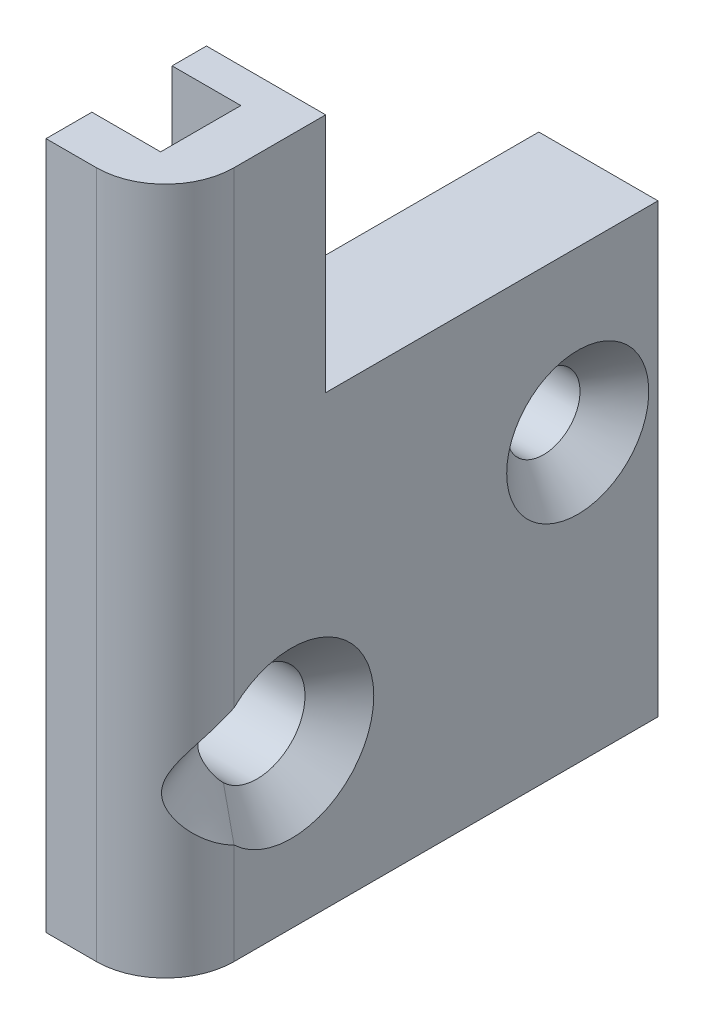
ISO-10303-21;
HEADER;
FILE_DESCRIPTION(('STEP AP214'),'2;1');
FILE_NAME('part.step','',(''),(''),'','','');
FILE_SCHEMA(('AUTOMOTIVE_DESIGN { 1 0 10303 214 1 1 1 1 }'));
ENDSEC;
DATA;
#1=APPLICATION_CONTEXT('core data for automotive mechanical design processes');
#2=APPLICATION_PROTOCOL_DEFINITION('international standard','automotive_design',2000,#1);
#3=PRODUCT_CONTEXT('',#1,'mechanical');
#4=PRODUCT('Part','Part','',(#3));
#5=PRODUCT_RELATED_PRODUCT_CATEGORY('part','',(#4));
#6=PRODUCT_DEFINITION_FORMATION('','',#4);
#7=PRODUCT_DEFINITION_CONTEXT('part definition',#1,'design');
#8=PRODUCT_DEFINITION('design','',#6,#7);
#9=PRODUCT_DEFINITION_SHAPE('','',#8);
#10=(LENGTH_UNIT() NAMED_UNIT(*) SI_UNIT(.MILLI.,.METRE.));
#11=(NAMED_UNIT(*) PLANE_ANGLE_UNIT() SI_UNIT($,.RADIAN.));
#12=(NAMED_UNIT(*) SI_UNIT($,.STERADIAN.) SOLID_ANGLE_UNIT());
#13=UNCERTAINTY_MEASURE_WITH_UNIT(LENGTH_MEASURE(1.E-05),#10,'distance_accuracy_value','');
#14=(GEOMETRIC_REPRESENTATION_CONTEXT(3) GLOBAL_UNCERTAINTY_ASSIGNED_CONTEXT((#13)) GLOBAL_UNIT_ASSIGNED_CONTEXT((#10,
#11,#12)) REPRESENTATION_CONTEXT('',''));
#15=CARTESIAN_POINT('',(0.,0.,0.));
#16=DIRECTION('',(0.,0.,1.));
#17=DIRECTION('',(1.,0.,0.));
#18=AXIS2_PLACEMENT_3D('',#15,#16,#17);
#19=CARTESIAN_POINT('',(5.2,19.5,0.));
#20=DIRECTION('',(0.,0.,1.));
#21=DIRECTION('',(1.,0.,0.));
#22=AXIS2_PLACEMENT_3D('',#19,#20,#21);
#23=PLANE('',#22);
#24=DIRECTION('',(0.,1.,0.));
#25=VECTOR('',#24,1.);
#26=CARTESIAN_POINT('',(0.,19.5,0.));
#27=LINE('',#26,#25);
#28=CARTESIAN_POINT('',(0.,0.,0.));
#29=VERTEX_POINT('',#28);
#30=CARTESIAN_POINT('',(0.,19.5,0.));
#31=VERTEX_POINT('',#30);
#32=EDGE_CURVE('E236',#29,#31,#27,.T.);
#33=ORIENTED_EDGE('',*,*,#32,.T.);
#34=DIRECTION('',(-1.,0.,0.));
#35=VECTOR('',#34,1.);
#36=CARTESIAN_POINT('',(5.2,19.5,0.));
#37=LINE('',#36,#35);
#38=CARTESIAN_POINT('',(5.2,19.5,0.));
#39=VERTEX_POINT('',#38);
#40=EDGE_CURVE('E280',#39,#31,#37,.T.);
#41=ORIENTED_EDGE('',*,*,#40,.F.);
#42=DIRECTION('',(0.,1.,0.));
#43=VECTOR('',#42,1.);
#44=CARTESIAN_POINT('',(5.2,19.5,0.));
#45=LINE('',#44,#43);
#46=CARTESIAN_POINT('',(5.2,0.,0.));
#47=VERTEX_POINT('',#46);
#48=EDGE_CURVE('E240',#47,#39,#45,.T.);
#49=ORIENTED_EDGE('',*,*,#48,.F.);
#50=DIRECTION('',(-1.,0.,0.));
#51=VECTOR('',#50,1.);
#52=CARTESIAN_POINT('',(5.2,0.,0.));
#53=LINE('',#52,#51);
#54=EDGE_CURVE('E253',#47,#29,#53,.T.);
#55=ORIENTED_EDGE('',*,*,#54,.T.);
#56=EDGE_LOOP('',(#33,#41,#49,#55));
#57=FACE_BOUND('',#56,.T.);
#58=ADVANCED_FACE('F35',(#57),#23,.F.);
#59=CARTESIAN_POINT('',(5.2,19.5,14.5));
#60=DIRECTION('',(0.,-1.,0.));
#61=DIRECTION('',(0.,0.,-1.));
#62=AXIS2_PLACEMENT_3D('',#59,#60,#61);
#63=PLANE('',#62);
#64=DIRECTION('',(0.,0.,1.));
#65=VECTOR('',#64,1.);
#66=CARTESIAN_POINT('',(0.,19.5,14.5));
#67=LINE('',#66,#65);
#68=CARTESIAN_POINT('',(0.,19.5,14.5));
#69=VERTEX_POINT('',#68);
#70=EDGE_CURVE('E256',#31,#69,#67,.T.);
#71=ORIENTED_EDGE('',*,*,#70,.T.);
#72=DIRECTION('',(-1.,0.,0.));
#73=VECTOR('',#72,1.);
#74=CARTESIAN_POINT('',(5.2,19.5,14.5));
#75=LINE('',#74,#73);
#76=CARTESIAN_POINT('',(5.2,19.5,14.5));
#77=VERTEX_POINT('',#76);
#78=EDGE_CURVE('E277',#77,#69,#75,.T.);
#79=ORIENTED_EDGE('',*,*,#78,.F.);
#80=DIRECTION('',(0.,0.,1.));
#81=VECTOR('',#80,1.);
#82=CARTESIAN_POINT('',(5.2,19.5,14.5));
#83=LINE('',#82,#81);
#84=EDGE_CURVE('E243',#39,#77,#83,.T.);
#85=ORIENTED_EDGE('',*,*,#84,.F.);
#86=ORIENTED_EDGE('',*,*,#40,.T.);
#87=EDGE_LOOP('',(#71,#79,#85,#86));
#88=FACE_BOUND('',#87,.T.);
#89=ADVANCED_FACE('F484',(#88),#63,.F.);
#90=CARTESIAN_POINT('',(5.2,30.,14.5));
#91=DIRECTION('',(0.,0.,1.));
#92=DIRECTION('',(0.,-1.,0.));
#93=AXIS2_PLACEMENT_3D('',#90,#91,#92);
#94=PLANE('',#93);
#95=DIRECTION('',(0.,1.,0.));
#96=VECTOR('',#95,1.);
#97=CARTESIAN_POINT('',(0.,30.,14.5));
#98=LINE('',#97,#96);
#99=CARTESIAN_POINT('',(0.,30.,14.5));
#100=VERTEX_POINT('',#99);
#101=EDGE_CURVE('E258',#69,#100,#98,.T.);
#102=ORIENTED_EDGE('',*,*,#101,.T.);
#103=DIRECTION('',(-1.,0.,0.));
#104=VECTOR('',#103,1.);
#105=CARTESIAN_POINT('',(5.2,30.,14.5));
#106=LINE('',#105,#104);
#107=CARTESIAN_POINT('',(5.2,30.,14.5));
#108=VERTEX_POINT('',#107);
#109=EDGE_CURVE('E274',#108,#100,#106,.T.);
#110=ORIENTED_EDGE('',*,*,#109,.F.);
#111=DIRECTION('',(0.,1.,0.));
#112=VECTOR('',#111,1.);
#113=CARTESIAN_POINT('',(5.2,30.,14.5));
#114=LINE('',#113,#112);
#115=EDGE_CURVE('E246',#77,#108,#114,.T.);
#116=ORIENTED_EDGE('',*,*,#115,.F.);
#117=ORIENTED_EDGE('',*,*,#78,.T.);
#118=EDGE_LOOP('',(#102,#110,#116,#117));
#119=FACE_BOUND('',#118,.T.);
#120=ADVANCED_FACE('F365',(#119),#94,.F.);
#121=CARTESIAN_POINT('',(5.2,30.,21.5));
#122=DIRECTION('',(0.,-1.,0.));
#123=DIRECTION('',(0.,0.,-1.));
#124=AXIS2_PLACEMENT_3D('',#121,#122,#123);
#125=PLANE('',#124);
#126=DIRECTION('',(-1.,0.,0.));
#127=VECTOR('',#126,1.);
#128=CARTESIAN_POINT('',(5.2,30.,21.5));
#129=LINE('',#128,#127);
#130=CARTESIAN_POINT('',(2.2,30.,21.5));
#131=VERTEX_POINT('',#130);
#132=CARTESIAN_POINT('',(0.,30.,21.5));
#133=VERTEX_POINT('',#132);
#134=EDGE_CURVE('E272',#131,#133,#129,.T.);
#135=ORIENTED_EDGE('',*,*,#134,.F.);
#136=CARTESIAN_POINT('',(2.2,30.,18.5));
#137=DIRECTION('',(0.,-1.,0.));
#138=DIRECTION('',(0.,0.,-1.));
#139=AXIS2_PLACEMENT_3D('',#136,#137,#138);
#140=CIRCLE('',#139,3.);
#141=CARTESIAN_POINT('',(5.2,30.,18.5));
#142=VERTEX_POINT('',#141);
#143=EDGE_CURVE('E336',#131,#142,#140,.F.);
#144=ORIENTED_EDGE('',*,*,#143,.T.);
#145=DIRECTION('',(0.,0.,1.));
#146=VECTOR('',#145,1.);
#147=CARTESIAN_POINT('',(5.2,30.,21.5));
#148=LINE('',#147,#146);
#149=EDGE_CURVE('E248',#108,#142,#148,.T.);
#150=ORIENTED_EDGE('',*,*,#149,.F.);
#151=ORIENTED_EDGE('',*,*,#109,.T.);
#152=DIRECTION('',(0.,0.,1.));
#153=VECTOR('',#152,1.);
#154=CARTESIAN_POINT('',(0.,30.,21.5));
#155=LINE('',#154,#153);
#156=CARTESIAN_POINT('',(0.,30.,16.));
#157=VERTEX_POINT('',#156);
#158=EDGE_CURVE('E261',#100,#157,#155,.T.);
#159=ORIENTED_EDGE('',*,*,#158,.T.);
#160=DIRECTION('',(-1.,0.,0.));
#161=VECTOR('',#160,1.);
#162=CARTESIAN_POINT('',(3.,30.,16.));
#163=LINE('',#162,#161);
#164=CARTESIAN_POINT('',(3.,30.,16.));
#165=VERTEX_POINT('',#164);
#166=EDGE_CURVE('E226',#165,#157,#163,.T.);
#167=ORIENTED_EDGE('',*,*,#166,.F.);
#168=DIRECTION('',(0.,0.,-1.));
#169=VECTOR('',#168,1.);
#170=CARTESIAN_POINT('',(3.,30.,19.5));
#171=LINE('',#170,#169);
#172=CARTESIAN_POINT('',(3.,30.,19.5));
#173=VERTEX_POINT('',#172);
#174=EDGE_CURVE('E215',#173,#165,#171,.T.);
#175=ORIENTED_EDGE('',*,*,#174,.F.);
#176=DIRECTION('',(-1.,0.,0.));
#177=VECTOR('',#176,1.);
#178=CARTESIAN_POINT('',(3.,30.,19.5));
#179=LINE('',#178,#177);
#180=CARTESIAN_POINT('',(0.,30.,19.5));
#181=VERTEX_POINT('',#180);
#182=EDGE_CURVE('E189',#173,#181,#179,.T.);
#183=ORIENTED_EDGE('',*,*,#182,.T.);
#184=EDGE_CURVE('E260',#181,#133,#155,.T.);
#185=ORIENTED_EDGE('',*,*,#184,.T.);
#186=EDGE_LOOP('',(#135,#144,#150,#151,#159,#167,#175,#183,#185));
#187=FACE_BOUND('',#186,.T.);
#188=ADVANCED_FACE('F357',(#187),#125,.F.);
#189=CARTESIAN_POINT('',(5.2,0.,21.5));
#190=DIRECTION('',(0.,0.,-1.));
#191=DIRECTION('',(-1.,0.,0.));
#192=AXIS2_PLACEMENT_3D('',#189,#190,#191);
#193=PLANE('',#192);
#194=DIRECTION('',(-1.,0.,0.));
#195=VECTOR('',#194,1.);
#196=CARTESIAN_POINT('',(5.2,0.,21.5));
#197=LINE('',#196,#195);
#198=CARTESIAN_POINT('',(2.2,0.,21.5));
#199=VERTEX_POINT('',#198);
#200=CARTESIAN_POINT('',(0.,0.,21.5));
#201=VERTEX_POINT('',#200);
#202=EDGE_CURVE('E270',#199,#201,#197,.T.);
#203=ORIENTED_EDGE('',*,*,#202,.F.);
#204=DIRECTION('',(0.,-1.,0.));
#205=VECTOR('',#204,1.);
#206=CARTESIAN_POINT('',(2.2,0.,21.5));
#207=LINE('',#206,#205);
#208=EDGE_CURVE('E337',#199,#131,#207,.F.);
#209=ORIENTED_EDGE('',*,*,#208,.T.);
#210=ORIENTED_EDGE('',*,*,#134,.T.);
#211=DIRECTION('',(0.,-1.,0.));
#212=VECTOR('',#211,1.);
#213=CARTESIAN_POINT('',(0.,0.,21.5));
#214=LINE('',#213,#212);
#215=EDGE_CURVE('E264',#133,#201,#214,.T.);
#216=ORIENTED_EDGE('',*,*,#215,.T.);
#217=EDGE_LOOP('',(#203,#209,#210,#216));
#218=FACE_BOUND('',#217,.T.);
#219=ADVANCED_FACE('F349',(#218),#193,.F.);
#220=CARTESIAN_POINT('',(5.2,0.,0.));
#221=DIRECTION('',(0.,1.,0.));
#222=DIRECTION('',(0.,0.,1.));
#223=AXIS2_PLACEMENT_3D('',#220,#221,#222);
#224=PLANE('',#223);
#225=DIRECTION('',(0.,0.,-1.));
#226=VECTOR('',#225,1.);
#227=CARTESIAN_POINT('',(5.2,0.,0.));
#228=LINE('',#227,#226);
#229=CARTESIAN_POINT('',(5.2,0.,18.5));
#230=VERTEX_POINT('',#229);
#231=EDGE_CURVE('E251',#230,#47,#228,.T.);
#232=ORIENTED_EDGE('',*,*,#231,.F.);
#233=CARTESIAN_POINT('',(2.2,0.,18.5));
#234=DIRECTION('',(0.,1.,0.));
#235=DIRECTION('',(0.,0.,1.));
#236=AXIS2_PLACEMENT_3D('',#233,#234,#235);
#237=CIRCLE('',#236,3.);
#238=EDGE_CURVE('E323',#230,#199,#237,.F.);
#239=ORIENTED_EDGE('',*,*,#238,.T.);
#240=ORIENTED_EDGE('',*,*,#202,.T.);
#241=DIRECTION('',(0.,0.,-1.));
#242=VECTOR('',#241,1.);
#243=CARTESIAN_POINT('',(0.,0.,0.));
#244=LINE('',#243,#242);
#245=EDGE_CURVE('E244',#201,#29,#244,.T.);
#246=ORIENTED_EDGE('',*,*,#245,.T.);
#247=ORIENTED_EDGE('',*,*,#54,.F.);
#248=EDGE_LOOP('',(#232,#239,#240,#246,#247));
#249=FACE_BOUND('',#248,.T.);
#250=ADVANCED_FACE('F345',(#249),#224,.F.);
#251=CARTESIAN_POINT('',(5.2,0.,0.));
#252=DIRECTION('',(-1.,0.,0.));
#253=DIRECTION('',(0.,0.,1.));
#254=AXIS2_PLACEMENT_3D('',#251,#252,#253);
#255=PLANE('',#254);
#256=CARTESIAN_POINT('',(5.2,12.5,3.5));
#257=DIRECTION('',(-1.,0.,0.));
#258=DIRECTION('',(0.,0.,1.));
#259=AXIS2_PLACEMENT_3D('',#256,#257,#258);
#260=CIRCLE('',#259,3.1);
#261=CARTESIAN_POINT('',(5.2,12.5,6.6));
#262=VERTEX_POINT('',#261);
#263=EDGE_CURVE('E512',#262,#262,#260,.T.);
#264=ORIENTED_EDGE('',*,*,#263,.T.);
#265=EDGE_LOOP('',(#264));
#266=FACE_BOUND('',#265,.T.);
#267=DIRECTION('',(0.,-1.,0.));
#268=VECTOR('',#267,1.);
#269=CARTESIAN_POINT('',(5.2,0.,18.5));
#270=LINE('',#269,#268);
#271=CARTESIAN_POINT('',(5.2,9.59036676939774,18.5));
#272=VERTEX_POINT('',#271);
#273=EDGE_CURVE('E329',#142,#272,#270,.T.);
#274=ORIENTED_EDGE('',*,*,#273,.T.);
#275=CARTESIAN_POINT('',(5.2,7.,16.));
#276=DIRECTION('',(-1.,0.,0.));
#277=DIRECTION('',(0.,0.,1.));
#278=AXIS2_PLACEMENT_3D('',#275,#276,#277);
#279=CIRCLE('',#278,3.60000000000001);
#280=CARTESIAN_POINT('',(5.2,4.40963323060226,18.5));
#281=VERTEX_POINT('',#280);
#282=EDGE_CURVE('E335',#272,#281,#279,.T.);
#283=ORIENTED_EDGE('',*,*,#282,.T.);
#284=EDGE_CURVE('E320',#281,#230,#270,.T.);
#285=ORIENTED_EDGE('',*,*,#284,.T.);
#286=ORIENTED_EDGE('',*,*,#231,.T.);
#287=ORIENTED_EDGE('',*,*,#48,.T.);
#288=ORIENTED_EDGE('',*,*,#84,.T.);
#289=ORIENTED_EDGE('',*,*,#115,.T.);
#290=ORIENTED_EDGE('',*,*,#149,.T.);
#291=EDGE_LOOP('',(#274,#283,#285,#286,#287,#288,#289,#290));
#292=FACE_BOUND('',#291,.T.);
#293=ADVANCED_FACE('F360',(#266,#292),#255,.F.);
#294=CARTESIAN_POINT('',(0.,0.,0.));
#295=DIRECTION('',(-1.,0.,0.));
#296=DIRECTION('',(0.,0.,1.));
#297=AXIS2_PLACEMENT_3D('',#294,#295,#296);
#298=PLANE('',#297);
#299=CARTESIAN_POINT('',(0.,7.,16.));
#300=DIRECTION('',(-1.,0.,0.));
#301=DIRECTION('',(0.,0.,1.));
#302=AXIS2_PLACEMENT_3D('',#299,#300,#301);
#303=CIRCLE('',#302,2.1);
#304=CARTESIAN_POINT('',(0.,7.,18.1));
#305=VERTEX_POINT('',#304);
#306=EDGE_CURVE('E206',#305,#305,#303,.F.);
#307=ORIENTED_EDGE('',*,*,#306,.T.);
#308=EDGE_LOOP('',(#307));
#309=FACE_BOUND('',#308,.T.);
#310=CARTESIAN_POINT('',(0.,12.5,3.5));
#311=DIRECTION('',(-1.,0.,0.));
#312=DIRECTION('',(0.,0.,1.));
#313=AXIS2_PLACEMENT_3D('',#310,#311,#312);
#314=CIRCLE('',#313,1.6);
#315=CARTESIAN_POINT('',(0.,12.5,5.1));
#316=VERTEX_POINT('',#315);
#317=EDGE_CURVE('E209',#316,#316,#314,.F.);
#318=ORIENTED_EDGE('',*,*,#317,.T.);
#319=EDGE_LOOP('',(#318));
#320=FACE_BOUND('',#319,.T.);
#321=CARTESIAN_POINT('',(0.,17.,16.5));
#322=DIRECTION('',(-1.,0.,0.));
#323=DIRECTION('',(0.,0.,1.));
#324=AXIS2_PLACEMENT_3D('',#321,#322,#323);
#325=CIRCLE('',#324,3.);
#326=CARTESIAN_POINT('',(0.,17.,19.5));
#327=VERTEX_POINT('',#326);
#328=CARTESIAN_POINT('',(0.,14.5335393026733,18.2077973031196));
#329=VERTEX_POINT('',#328);
#330=EDGE_CURVE('E295',#327,#329,#325,.F.);
#331=ORIENTED_EDGE('',*,*,#330,.T.);
#332=CARTESIAN_POINT('',(0.,-1.90953201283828,29.5931126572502));
#333=DIRECTION('',(-1.,0.,0.));
#334=DIRECTION('',(0.,0.,1.));
#335=AXIS2_PLACEMENT_3D('',#332,#333,#334);
#336=CIRCLE('',#335,20.);
#337=CARTESIAN_POINT('',(0.,8.80206786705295,12.7034226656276));
#338=VERTEX_POINT('',#337);
#339=EDGE_CURVE('E303',#329,#338,#336,.T.);
#340=ORIENTED_EDGE('',*,*,#339,.T.);
#341=DIRECTION('',(0.,0.844484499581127,0.535579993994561));
#342=VECTOR('',#341,1.);
#343=CARTESIAN_POINT('',(0.,2.48989002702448,8.70018024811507));
#344=LINE('',#343,#342);
#345=CARTESIAN_POINT('',(0.,2.48989002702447,8.70018024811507));
#346=VERTEX_POINT('',#345);
#347=EDGE_CURVE('E232',#346,#338,#344,.T.);
#348=ORIENTED_EDGE('',*,*,#347,.F.);
#349=CARTESIAN_POINT('',(0.,4.9,4.9));
#350=DIRECTION('',(-1.,0.,0.));
#351=DIRECTION('',(0.,0.,1.));
#352=AXIS2_PLACEMENT_3D('',#349,#350,#351);
#353=CIRCLE('',#352,4.5);
#354=CARTESIAN_POINT('',(0.,8.48124602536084,2.17517396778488));
#355=VERTEX_POINT('',#354);
#356=EDGE_CURVE('E185',#355,#346,#353,.T.);
#357=ORIENTED_EDGE('',*,*,#356,.F.);
#358=DIRECTION('',(0.,-0.605516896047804,-0.795832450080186));
#359=VECTOR('',#358,1.);
#360=CARTESIAN_POINT('',(0.,8.48124602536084,2.17517396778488));
#361=LINE('',#360,#359);
#362=CARTESIAN_POINT('',(0.,18.0995610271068,14.8165506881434));
#363=VERTEX_POINT('',#362);
#364=EDGE_CURVE('E229',#363,#355,#361,.T.);
#365=ORIENTED_EDGE('',*,*,#364,.F.);
#366=CARTESIAN_POINT('',(0.,20.4870583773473,13.));
#367=DIRECTION('',(-1.,0.,0.));
#368=DIRECTION('',(0.,0.,1.));
#369=AXIS2_PLACEMENT_3D('',#366,#367,#368);
#370=CIRCLE('',#369,3.);
#371=CARTESIAN_POINT('',(0.,20.4870583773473,16.));
#372=VERTEX_POINT('',#371);
#373=EDGE_CURVE('E291',#363,#372,#370,.T.);
#374=ORIENTED_EDGE('',*,*,#373,.T.);
#375=DIRECTION('',(0.,-1.,0.));
#376=VECTOR('',#375,1.);
#377=CARTESIAN_POINT('',(0.,30.,16.));
#378=LINE('',#377,#376);
#379=EDGE_CURVE('E214',#157,#372,#378,.T.);
#380=ORIENTED_EDGE('',*,*,#379,.F.);
#381=ORIENTED_EDGE('',*,*,#158,.F.);
#382=ORIENTED_EDGE('',*,*,#101,.F.);
#383=ORIENTED_EDGE('',*,*,#70,.F.);
#384=ORIENTED_EDGE('',*,*,#32,.F.);
#385=ORIENTED_EDGE('',*,*,#245,.F.);
#386=ORIENTED_EDGE('',*,*,#215,.F.);
#387=ORIENTED_EDGE('',*,*,#184,.F.);
#388=DIRECTION('',(0.,1.,0.));
#389=VECTOR('',#388,1.);
#390=CARTESIAN_POINT('',(0.,14.,19.5));
#391=LINE('',#390,#389);
#392=EDGE_CURVE('E219',#327,#181,#391,.T.);
#393=ORIENTED_EDGE('',*,*,#392,.F.);
#394=EDGE_LOOP('',(#331,#340,#348,#357,#365,#374,#380,#381,#382,#383,#384,#385,#386,#387,#393));
#395=FACE_BOUND('',#394,.T.);
#396=ADVANCED_FACE('F371',(#309,#320,#395),#298,.T.);
#397=CARTESIAN_POINT('',(3.,14.,19.5));
#398=DIRECTION('',(0.,0.,1.));
#399=DIRECTION('',(1.,0.,0.));
#400=AXIS2_PLACEMENT_3D('',#397,#398,#399);
#401=PLANE('',#400);
#402=DIRECTION('',(0.,1.,0.));
#403=VECTOR('',#402,1.);
#404=CARTESIAN_POINT('',(3.,14.,19.5));
#405=LINE('',#404,#403);
#406=CARTESIAN_POINT('',(3.,17.,19.5));
#407=VERTEX_POINT('',#406);
#408=EDGE_CURVE('E224',#407,#173,#405,.T.);
#409=ORIENTED_EDGE('',*,*,#408,.F.);
#410=DIRECTION('',(-1.,0.,0.));
#411=VECTOR('',#410,1.);
#412=CARTESIAN_POINT('',(0.,17.,19.5));
#413=LINE('',#412,#411);
#414=EDGE_CURVE('E283',#407,#327,#413,.T.);
#415=ORIENTED_EDGE('',*,*,#414,.T.);
#416=ORIENTED_EDGE('',*,*,#392,.T.);
#417=ORIENTED_EDGE('',*,*,#182,.F.);
#418=EDGE_LOOP('',(#409,#415,#416,#417));
#419=FACE_BOUND('',#418,.T.);
#420=ADVANCED_FACE('F401',(#419),#401,.F.);
#421=CARTESIAN_POINT('',(3.,2.48989002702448,8.70018024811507));
#422=DIRECTION('',(0.,-0.535579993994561,0.844484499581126));
#423=DIRECTION('',(0.,-0.844484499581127,-0.535579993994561));
#424=AXIS2_PLACEMENT_3D('',#421,#422,#423);
#425=PLANE('',#424);
#426=ORIENTED_EDGE('',*,*,#347,.T.);
#427=DIRECTION('',(1.,0.,0.));
#428=VECTOR('',#427,1.);
#429=CARTESIAN_POINT('',(3.,8.80206786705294,12.7034226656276));
#430=LINE('',#429,#428);
#431=CARTESIAN_POINT('',(4.3,8.80206786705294,12.7034226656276));
#432=VERTEX_POINT('',#431);
#433=EDGE_CURVE('E196',#338,#432,#430,.T.);
#434=ORIENTED_EDGE('',*,*,#433,.T.);
#435=DIRECTION('',(0.,0.844484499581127,0.535579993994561));
#436=VECTOR('',#435,1.);
#437=CARTESIAN_POINT('',(4.3,2.48989002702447,8.70018024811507));
#438=LINE('',#437,#436);
#439=CARTESIAN_POINT('',(4.3,2.48989002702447,8.70018024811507));
#440=VERTEX_POINT('',#439);
#441=EDGE_CURVE('E193',#440,#432,#438,.T.);
#442=ORIENTED_EDGE('',*,*,#441,.F.);
#443=DIRECTION('',(-1.,0.,0.));
#444=VECTOR('',#443,1.);
#445=CARTESIAN_POINT('',(3.,2.48989002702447,8.70018024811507));
#446=LINE('',#445,#444);
#447=EDGE_CURVE('E178',#440,#346,#446,.T.);
#448=ORIENTED_EDGE('',*,*,#447,.T.);
#449=EDGE_LOOP('',(#426,#434,#442,#448));
#450=FACE_BOUND('',#449,.T.);
#451=ADVANCED_FACE('F194',(#450),#425,.F.);
#452=CARTESIAN_POINT('',(3.,4.9,4.9));
#453=DIRECTION('',(-1.,0.,0.));
#454=DIRECTION('',(0.,0.,1.));
#455=AXIS2_PLACEMENT_3D('',#452,#453,#454);
#456=CYLINDRICAL_SURFACE('',#455,4.5);
#457=ORIENTED_EDGE('',*,*,#356,.T.);
#458=ORIENTED_EDGE('',*,*,#447,.F.);
#459=CARTESIAN_POINT('',(4.3,4.9,4.9));
#460=DIRECTION('',(-1.,0.,0.));
#461=DIRECTION('',(0.,0.,1.));
#462=AXIS2_PLACEMENT_3D('',#459,#460,#461);
#463=CIRCLE('',#462,4.5);
#464=CARTESIAN_POINT('',(4.3,8.48124602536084,2.17517396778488));
#465=VERTEX_POINT('',#464);
#466=EDGE_CURVE('E183',#465,#440,#463,.T.);
#467=ORIENTED_EDGE('',*,*,#466,.F.);
#468=DIRECTION('',(-1.,0.,0.));
#469=VECTOR('',#468,1.);
#470=CARTESIAN_POINT('',(3.,8.48124602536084,2.17517396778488));
#471=LINE('',#470,#469);
#472=EDGE_CURVE('E190',#465,#355,#471,.T.);
#473=ORIENTED_EDGE('',*,*,#472,.T.);
#474=EDGE_LOOP('',(#457,#458,#467,#473));
#475=FACE_BOUND('',#474,.T.);
#476=ADVANCED_FACE('F180',(#475),#456,.F.);
#477=CARTESIAN_POINT('',(3.,8.48124602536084,2.17517396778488));
#478=DIRECTION('',(0.,0.795832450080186,-0.605516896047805));
#479=DIRECTION('',(0.,0.605516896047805,0.795832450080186));
#480=AXIS2_PLACEMENT_3D('',#477,#478,#479);
#481=PLANE('',#480);
#482=DIRECTION('',(-0.476042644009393,0.532504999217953,0.699872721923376));
#483=VECTOR('',#482,1.);
#484=CARTESIAN_POINT('',(4.08895691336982,13.5395450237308,8.82330965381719));
#485=LINE('',#484,#483);
#486=CARTESIAN_POINT('',(4.3,13.3034705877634,8.51303640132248));
#487=VERTEX_POINT('',#486);
#488=CARTESIAN_POINT('',(3.,14.7576606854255,10.4242822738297));
#489=VERTEX_POINT('',#488);
#490=EDGE_CURVE('E312',#487,#489,#485,.T.);
#491=ORIENTED_EDGE('',*,*,#490,.T.);
#492=DIRECTION('',(0.,-0.605516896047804,-0.795832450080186));
#493=VECTOR('',#492,1.);
#494=CARTESIAN_POINT('',(3.,8.48124602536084,2.17517396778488));
#495=LINE('',#494,#493);
#496=CARTESIAN_POINT('',(3.,18.0995610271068,14.8165506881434));
#497=VERTEX_POINT('',#496);
#498=EDGE_CURVE('E222',#497,#489,#495,.T.);
#499=ORIENTED_EDGE('',*,*,#498,.F.);
#500=DIRECTION('',(-1.,0.,0.));
#501=VECTOR('',#500,1.);
#502=CARTESIAN_POINT('',(3.,18.0995610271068,14.8165506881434));
#503=LINE('',#502,#501);
#504=EDGE_CURVE('E288',#497,#363,#503,.T.);
#505=ORIENTED_EDGE('',*,*,#504,.T.);
#506=ORIENTED_EDGE('',*,*,#364,.T.);
#507=ORIENTED_EDGE('',*,*,#472,.F.);
#508=DIRECTION('',(0.,-0.605516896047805,-0.795832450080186));
#509=VECTOR('',#508,1.);
#510=CARTESIAN_POINT('',(4.3,8.48124602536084,2.17517396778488));
#511=LINE('',#510,#509);
#512=EDGE_CURVE('E200',#487,#465,#511,.T.);
#513=ORIENTED_EDGE('',*,*,#512,.F.);
#514=EDGE_LOOP('',(#491,#499,#505,#506,#507,#513));
#515=FACE_BOUND('',#514,.T.);
#516=ADVANCED_FACE('F384',(#515),#481,.F.);
#517=CARTESIAN_POINT('',(3.,30.,16.));
#518=DIRECTION('',(0.,0.,-1.));
#519=DIRECTION('',(0.,1.,0.));
#520=AXIS2_PLACEMENT_3D('',#517,#518,#519);
#521=PLANE('',#520);
#522=ORIENTED_EDGE('',*,*,#379,.T.);
#523=DIRECTION('',(-1.,0.,0.));
#524=VECTOR('',#523,1.);
#525=CARTESIAN_POINT('',(3.,20.4870583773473,16.));
#526=LINE('',#525,#524);
#527=CARTESIAN_POINT('',(3.,20.4870583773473,16.));
#528=VERTEX_POINT('',#527);
#529=EDGE_CURVE('E293',#372,#528,#526,.F.);
#530=ORIENTED_EDGE('',*,*,#529,.T.);
#531=DIRECTION('',(0.,-1.,0.));
#532=VECTOR('',#531,1.);
#533=CARTESIAN_POINT('',(3.,30.,16.));
#534=LINE('',#533,#532);
#535=EDGE_CURVE('E218',#165,#528,#534,.T.);
#536=ORIENTED_EDGE('',*,*,#535,.F.);
#537=ORIENTED_EDGE('',*,*,#166,.T.);
#538=EDGE_LOOP('',(#522,#530,#536,#537));
#539=FACE_BOUND('',#538,.T.);
#540=ADVANCED_FACE('F375',(#539),#521,.F.);
#541=CARTESIAN_POINT('',(3.,4.9,4.9));
#542=DIRECTION('',(-1.,0.,0.));
#543=DIRECTION('',(0.,0.,1.));
#544=AXIS2_PLACEMENT_3D('',#541,#542,#543);
#545=PLANE('',#544);
#546=ORIENTED_EDGE('',*,*,#498,.T.);
#547=DIRECTION('',(0.,-0.535579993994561,0.844484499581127));
#548=VECTOR('',#547,1.);
#549=CARTESIAN_POINT('',(3.,14.4286029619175,10.9431294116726));
#550=LINE('',#549,#548);
#551=CARTESIAN_POINT('',(3.,11.8224640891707,15.0524014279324));
#552=VERTEX_POINT('',#551);
#553=EDGE_CURVE('E317',#489,#552,#550,.T.);
#554=ORIENTED_EDGE('',*,*,#553,.T.);
#555=CARTESIAN_POINT('',(3.,-1.90953201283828,29.5931126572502));
#556=DIRECTION('',(-1.,0.,0.));
#557=DIRECTION('',(0.,0.,1.));
#558=AXIS2_PLACEMENT_3D('',#555,#556,#557);
#559=CIRCLE('',#558,20.);
#560=CARTESIAN_POINT('',(3.,14.5335393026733,18.2077973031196));
#561=VERTEX_POINT('',#560);
#562=EDGE_CURVE('E308',#552,#561,#559,.F.);
#563=ORIENTED_EDGE('',*,*,#562,.T.);
#564=CARTESIAN_POINT('',(3.,17.,16.5));
#565=DIRECTION('',(-1.,0.,0.));
#566=DIRECTION('',(0.,0.,1.));
#567=AXIS2_PLACEMENT_3D('',#564,#565,#566);
#568=CIRCLE('',#567,3.);
#569=EDGE_CURVE('E286',#561,#407,#568,.T.);
#570=ORIENTED_EDGE('',*,*,#569,.T.);
#571=ORIENTED_EDGE('',*,*,#408,.T.);
#572=ORIENTED_EDGE('',*,*,#174,.T.);
#573=ORIENTED_EDGE('',*,*,#535,.T.);
#574=CARTESIAN_POINT('',(3.,20.4870583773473,13.));
#575=DIRECTION('',(-1.,0.,0.));
#576=DIRECTION('',(0.,0.,1.));
#577=AXIS2_PLACEMENT_3D('',#574,#575,#576);
#578=CIRCLE('',#577,3.);
#579=EDGE_CURVE('E298',#528,#497,#578,.F.);
#580=ORIENTED_EDGE('',*,*,#579,.T.);
#581=EDGE_LOOP('',(#546,#554,#563,#570,#571,#572,#573,#580));
#582=FACE_BOUND('',#581,.T.);
#583=ADVANCED_FACE('F382',(#582),#545,.T.);
#584=CARTESIAN_POINT('',(3.,17.,16.5));
#585=DIRECTION('',(1.,0.,0.));
#586=DIRECTION('',(0.,0.,-1.));
#587=AXIS2_PLACEMENT_3D('',#584,#585,#586);
#588=CYLINDRICAL_SURFACE('',#587,3.);
#589=ORIENTED_EDGE('',*,*,#569,.F.);
#590=DIRECTION('',(1.,0.,0.));
#591=VECTOR('',#590,1.);
#592=CARTESIAN_POINT('',(3.,14.5335393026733,18.2077973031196));
#593=LINE('',#592,#591);
#594=EDGE_CURVE('E300',#561,#329,#593,.F.);
#595=ORIENTED_EDGE('',*,*,#594,.T.);
#596=ORIENTED_EDGE('',*,*,#330,.F.);
#597=ORIENTED_EDGE('',*,*,#414,.F.);
#598=EDGE_LOOP('',(#589,#595,#596,#597));
#599=FACE_BOUND('',#598,.T.);
#600=ADVANCED_FACE('F396',(#599),#588,.F.);
#601=CARTESIAN_POINT('',(3.,20.4870583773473,13.));
#602=DIRECTION('',(-1.,0.,0.));
#603=DIRECTION('',(0.,0.,1.));
#604=AXIS2_PLACEMENT_3D('',#601,#602,#603);
#605=CYLINDRICAL_SURFACE('',#604,3.);
#606=ORIENTED_EDGE('',*,*,#579,.F.);
#607=ORIENTED_EDGE('',*,*,#529,.F.);
#608=ORIENTED_EDGE('',*,*,#373,.F.);
#609=ORIENTED_EDGE('',*,*,#504,.F.);
#610=EDGE_LOOP('',(#606,#607,#608,#609));
#611=FACE_BOUND('',#610,.T.);
#612=ADVANCED_FACE('F378',(#611),#605,.T.);
#613=CARTESIAN_POINT('',(4.3,4.9,4.9));
#614=DIRECTION('',(-1.,0.,0.));
#615=DIRECTION('',(0.,0.,1.));
#616=AXIS2_PLACEMENT_3D('',#613,#614,#615);
#617=PLANE('',#616);
#618=CARTESIAN_POINT('',(4.3,-1.90953201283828,29.5931126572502));
#619=DIRECTION('',(-1.,0.,0.));
#620=DIRECTION('',(0.,0.,1.));
#621=AXIS2_PLACEMENT_3D('',#618,#619,#620);
#622=CIRCLE('',#621,20.);
#623=CARTESIAN_POINT('',(4.3,10.0844838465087,13.5886262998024));
#624=VERTEX_POINT('',#623);
#625=EDGE_CURVE('E306',#432,#624,#622,.F.);
#626=ORIENTED_EDGE('',*,*,#625,.T.);
#627=DIRECTION('',(0.,0.535579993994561,-0.844484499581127));
#628=VECTOR('',#627,1.);
#629=CARTESIAN_POINT('',(4.3,12.5271058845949,9.73718212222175));
#630=LINE('',#629,#628);
#631=EDGE_CURVE('E310',#624,#487,#630,.T.);
#632=ORIENTED_EDGE('',*,*,#631,.T.);
#633=ORIENTED_EDGE('',*,*,#512,.T.);
#634=ORIENTED_EDGE('',*,*,#466,.T.);
#635=ORIENTED_EDGE('',*,*,#441,.T.);
#636=EDGE_LOOP('',(#626,#632,#633,#634,#635));
#637=FACE_BOUND('',#636,.T.);
#638=ADVANCED_FACE('F202',(#637),#617,.T.);
#639=CARTESIAN_POINT('',(3.,-1.90953201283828,29.5931126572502));
#640=DIRECTION('',(1.,0.,0.));
#641=DIRECTION('',(0.,0.,-1.));
#642=AXIS2_PLACEMENT_3D('',#639,#640,#641);
#643=CYLINDRICAL_SURFACE('',#642,20.);
#644=ORIENTED_EDGE('',*,*,#562,.F.);
#645=CARTESIAN_POINT('',(5.19897927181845,-1.90953201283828,29.5931126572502));
#646=DIRECTION('',(0.866025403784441,0.422242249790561,0.267789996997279));
#647=DIRECTION('',(0.499999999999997,-0.731345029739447,-0.463825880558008));
#648=AXIS2_PLACEMENT_3D('',#645,#646,#647);
#649=ELLIPSE('',#648,23.094010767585,20.);
#650=EDGE_CURVE('E315',#552,#624,#649,.F.);
#651=ORIENTED_EDGE('',*,*,#650,.T.);
#652=ORIENTED_EDGE('',*,*,#625,.F.);
#653=ORIENTED_EDGE('',*,*,#433,.F.);
#654=ORIENTED_EDGE('',*,*,#339,.F.);
#655=ORIENTED_EDGE('',*,*,#594,.F.);
#656=EDGE_LOOP('',(#644,#651,#652,#653,#654,#655));
#657=FACE_BOUND('',#656,.T.);
#658=ADVANCED_FACE('F397',(#657),#643,.T.);
#659=CARTESIAN_POINT('',(4.3,12.5271058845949,9.73718212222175));
#660=DIRECTION('',(0.866025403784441,0.422242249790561,0.267789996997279));
#661=DIRECTION('',(0.,0.535579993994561,-0.844484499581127));
#662=AXIS2_PLACEMENT_3D('',#659,#660,#661);
#663=PLANE('',#662);
#664=ORIENTED_EDGE('',*,*,#650,.F.);
#665=ORIENTED_EDGE('',*,*,#553,.F.);
#666=ORIENTED_EDGE('',*,*,#490,.F.);
#667=ORIENTED_EDGE('',*,*,#631,.F.);
#668=EDGE_LOOP('',(#664,#665,#666,#667));
#669=FACE_BOUND('',#668,.T.);
#670=ADVANCED_FACE('F389',(#669),#663,.F.);
#671=CARTESIAN_POINT('',(-0.00100000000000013,12.5,3.5));
#672=DIRECTION('',(1.,0.,0.));
#673=DIRECTION('',(0.,0.,-1.));
#674=AXIS2_PLACEMENT_3D('',#671,#672,#673);
#675=CYLINDRICAL_SURFACE('',#674,1.6);
#676=CARTESIAN_POINT('',(3.7,12.5,3.5));
#677=DIRECTION('',(-1.,0.,0.));
#678=DIRECTION('',(0.,0.,1.));
#679=AXIS2_PLACEMENT_3D('',#676,#677,#678);
#680=CIRCLE('',#679,1.6);
#681=CARTESIAN_POINT('',(3.7,12.5,5.1));
#682=VERTEX_POINT('',#681);
#683=EDGE_CURVE('E332',#682,#682,#680,.F.);
#684=ORIENTED_EDGE('',*,*,#683,.T.);
#685=EDGE_LOOP('',(#684));
#686=FACE_BOUND('',#685,.T.);
#687=ORIENTED_EDGE('',*,*,#317,.F.);
#688=EDGE_LOOP('',(#687));
#689=FACE_BOUND('',#688,.T.);
#690=ADVANCED_FACE('F471',(#686,#689),#675,.F.);
#691=CARTESIAN_POINT('',(-0.00100000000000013,7.,16.));
#692=DIRECTION('',(1.,0.,0.));
#693=DIRECTION('',(0.,0.,-1.));
#694=AXIS2_PLACEMENT_3D('',#691,#692,#693);
#695=CYLINDRICAL_SURFACE('',#694,2.1);
#696=CARTESIAN_POINT('',(3.69999999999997,7.,16.));
#697=DIRECTION('',(-1.,0.,0.));
#698=DIRECTION('',(0.,0.,1.));
#699=AXIS2_PLACEMENT_3D('',#696,#697,#698);
#700=CIRCLE('',#699,2.1);
#701=CARTESIAN_POINT('',(3.69999999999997,5.48895271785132,17.4583333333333));
#702=VERTEX_POINT('',#701);
#703=CARTESIAN_POINT('',(3.69999999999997,8.51104728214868,17.4583333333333));
#704=VERTEX_POINT('',#703);
#705=EDGE_CURVE('E52',#702,#704,#700,.F.);
#706=ORIENTED_EDGE('',*,*,#705,.T.);
#707=CARTESIAN_POINT('',(3.69999999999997,5.48895271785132,17.4583333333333));
#708=CARTESIAN_POINT('',(3.69998096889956,5.53910028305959,17.5102888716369));
#709=CARTESIAN_POINT('',(3.69215228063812,5.59130183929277,17.5590404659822));
#710=CARTESIAN_POINT('',(3.6655059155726,5.69979382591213,17.650607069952));
#711=CARTESIAN_POINT('',(3.64666661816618,5.75603117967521,17.6933860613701));
#712=CARTESIAN_POINT('',(3.60129082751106,5.87291807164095,17.7733297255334));
#713=CARTESIAN_POINT('',(3.57510883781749,5.93261416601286,17.8098319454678));
#714=CARTESIAN_POINT('',(3.51935837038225,6.05426627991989,17.8762702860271));
#715=CARTESIAN_POINT('',(3.48972190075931,6.11630185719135,17.9062587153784));
#716=CARTESIAN_POINT('',(3.43012989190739,6.24311352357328,17.9600679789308));
#717=CARTESIAN_POINT('',(3.40014150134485,6.30791515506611,17.9838912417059));
#718=CARTESIAN_POINT('',(3.34334026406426,6.44070196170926,18.0253531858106));
#719=CARTESIAN_POINT('',(3.31644644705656,6.50908517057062,18.043025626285));
#720=CARTESIAN_POINT('',(3.27108878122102,6.6464703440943,18.0712074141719));
#721=CARTESIAN_POINT('',(3.25240900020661,6.71604488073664,18.0819166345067));
#722=CARTESIAN_POINT('',(3.23315049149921,6.82166262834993,18.0927133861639));
#723=CARTESIAN_POINT('',(3.22818721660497,6.85711098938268,18.0954370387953));
#724=CARTESIAN_POINT('',(3.22150314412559,6.92845005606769,18.0990850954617));
#725=CARTESIAN_POINT('',(3.21978679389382,6.96445564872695,18.100009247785));
#726=CARTESIAN_POINT('',(3.21982125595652,7.03659806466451,18.099990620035));
#727=CARTESIAN_POINT('',(3.22155833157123,7.07236847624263,18.0990552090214));
#728=CARTESIAN_POINT('',(3.22827082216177,7.14354726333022,18.0953911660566));
#729=CARTESIAN_POINT('',(3.23324198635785,7.17891948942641,18.0926627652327));
#730=CARTESIAN_POINT('',(3.25252413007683,7.28442452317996,18.0818506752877));
#731=CARTESIAN_POINT('',(3.27120654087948,7.35396229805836,18.071141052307));
#732=CARTESIAN_POINT('',(3.30532447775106,7.45718860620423,18.0499324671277));
#733=CARTESIAN_POINT('',(3.31773403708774,7.49148615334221,18.0419787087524));
#734=CARTESIAN_POINT('',(3.34400730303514,7.55952976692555,18.0243913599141));
#735=CARTESIAN_POINT('',(3.35778665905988,7.59308073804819,18.0148129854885));
#736=CARTESIAN_POINT('',(3.40030783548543,7.69245236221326,17.9837599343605));
#737=CARTESIAN_POINT('',(3.43026858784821,7.75718423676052,17.9599508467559));
#738=CARTESIAN_POINT('',(3.48980708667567,7.88387675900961,17.9061736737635));
#739=CARTESIAN_POINT('',(3.5194298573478,7.94588797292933,17.8761917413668));
#740=CARTESIAN_POINT('',(3.56123644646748,8.03711598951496,17.8263604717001));
#741=CARTESIAN_POINT('',(3.57474772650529,8.06724894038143,17.8089225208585));
#742=CARTESIAN_POINT('',(3.60047158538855,8.12690412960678,17.7723750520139));
#743=CARTESIAN_POINT('',(3.61272739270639,8.15653319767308,17.7531921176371));
#744=CARTESIAN_POINT('',(3.63537682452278,8.21489568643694,17.7132650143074));
#745=CARTESIAN_POINT('',(3.6457333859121,8.24352137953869,17.6926027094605));
#746=CARTESIAN_POINT('',(3.66413863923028,8.29977873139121,17.6497953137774));
#747=CARTESIAN_POINT('',(3.67218404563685,8.32739414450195,17.6276618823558));
#748=CARTESIAN_POINT('',(3.69215559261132,8.40871633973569,17.5590225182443));
#749=CARTESIAN_POINT('',(3.69998080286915,8.4609016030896,17.5102868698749));
#750=CARTESIAN_POINT('',(3.69999999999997,8.51104728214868,17.4583333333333));
#751=B_SPLINE_CURVE_WITH_KNOTS('',3,(#707,#708,#709,#710,#711,#712,#713,#714,#715,#716,#717,
#718,#719,#720,#721,#722,#723,#724,#725,#726,#727,#728,#729,#730,#731,#732,#733,#734,#735,#736,
#737,#738,#739,#740,#741,#742,#743,#744,#745,#746,#747,#748,#749,#750),.UNSPECIFIED.,.F.,.F.,(4,
2,2,2,2,2,2,2,2,2,2,2,2,2,2,2,2,2,2,2,2,4),(0.,0.000367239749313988,0.000734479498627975,
0.00110171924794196,0.00146895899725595,0.00183619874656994,0.00220343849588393,
0.00257067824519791,0.00275429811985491,0.0029379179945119,0.0031215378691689,
0.00330515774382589,0.00367239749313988,0.00385601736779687,0.00403963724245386,
0.00440687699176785,0.00477411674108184,0.00495773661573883,0.00514135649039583,
0.00532497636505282,0.00550859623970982,0.0058758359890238),.UNSPECIFIED.);
#752=EDGE_CURVE('E46',#704,#702,#751,.F.);
#753=ORIENTED_EDGE('',*,*,#752,.T.);
#754=EDGE_LOOP('',(#706,#753));
#755=FACE_BOUND('',#754,.T.);
#756=ORIENTED_EDGE('',*,*,#306,.F.);
#757=EDGE_LOOP('',(#756));
#758=FACE_BOUND('',#757,.T.);
#759=ADVANCED_FACE('F473',(#755,#758),#695,.F.);
#760=CARTESIAN_POINT('',(2.2,0.,18.5));
#761=DIRECTION('',(0.,-1.,0.));
#762=DIRECTION('',(0.,0.,-1.));
#763=AXIS2_PLACEMENT_3D('',#760,#761,#762);
#764=CYLINDRICAL_SURFACE('',#763,3.);
#765=ORIENTED_EDGE('',*,*,#284,.F.);
#766=CARTESIAN_POINT('',(5.2,9.59036676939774,18.5));
#767=CARTESIAN_POINT('',(5.19996160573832,9.50440274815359,18.6781264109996));
#768=CARTESIAN_POINT('',(5.18431118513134,9.41494229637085,18.8452200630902));
#769=CARTESIAN_POINT('',(5.14436809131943,9.27553281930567,19.0805550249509));
#770=CARTESIAN_POINT('',(5.12827727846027,9.22819211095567,19.1564410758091));
#771=CARTESIAN_POINT('',(5.0914667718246,9.13175093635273,19.3032092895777));
#772=CARTESIAN_POINT('',(5.07075364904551,9.08267831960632,19.3740514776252));
#773=CARTESIAN_POINT('',(5.02545478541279,8.98262833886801,19.5109444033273));
#774=CARTESIAN_POINT('',(5.00094317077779,8.93183565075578,19.576714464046));
#775=CARTESIAN_POINT('',(4.94949545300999,8.82956961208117,19.7020200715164));
#776=CARTESIAN_POINT('',(4.92247289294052,8.77791312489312,19.761807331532));
#777=CARTESIAN_POINT('',(4.83885971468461,8.62152223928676,19.9326573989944));
#778=CARTESIAN_POINT('',(4.77961417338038,8.51521730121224,20.0354525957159));
#779=CARTESIAN_POINT('',(4.66053717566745,8.29803012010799,20.2198314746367));
#780=CARTESIAN_POINT('',(4.60061567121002,8.18706119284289,20.3014626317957));
#781=CARTESIAN_POINT('',(4.51557331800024,8.01670983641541,20.4079302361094));
#782=CARTESIAN_POINT('',(4.48801460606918,7.95919388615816,20.4407703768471));
#783=CARTESIAN_POINT('',(4.43546807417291,7.84254769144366,20.5010698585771));
#784=CARTESIAN_POINT('',(4.41064895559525,7.78375189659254,20.5283398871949));
#785=CARTESIAN_POINT('',(4.3424130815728,7.60679251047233,20.6010550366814));
#786=CARTESIAN_POINT('',(4.30504826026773,7.48758489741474,20.6377737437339));
#787=CARTESIAN_POINT('',(4.26648397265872,7.30671912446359,20.6748437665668));
#788=CARTESIAN_POINT('',(4.25654164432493,7.24608102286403,20.6841982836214));
#789=CARTESIAN_POINT('',(4.24311666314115,7.12406024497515,20.6967607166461));
#790=CARTESIAN_POINT('',(4.23964251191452,7.06273953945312,20.6999678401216));
#791=CARTESIAN_POINT('',(4.23957358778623,6.93906682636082,20.70003170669));
#792=CARTESIAN_POINT('',(4.24300628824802,6.87734295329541,20.6968631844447));
#793=CARTESIAN_POINT('',(4.25637443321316,6.7550474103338,20.6843555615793));
#794=CARTESIAN_POINT('',(4.26630098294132,6.69427879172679,20.675017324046));
#795=CARTESIAN_POINT('',(4.30481800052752,6.51321979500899,20.6379998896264));
#796=CARTESIAN_POINT('',(4.34217756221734,6.39394916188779,20.6012825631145));
#797=CARTESIAN_POINT('',(4.4328928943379,6.15843172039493,20.5046592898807));
#798=CARTESIAN_POINT('',(4.48668052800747,6.04120336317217,20.4440680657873));
#799=CARTESIAN_POINT('',(4.60028300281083,5.81356883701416,20.3019128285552));
#800=CARTESIAN_POINT('',(4.66025978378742,5.70248032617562,20.2202330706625));
#801=CARTESIAN_POINT('',(4.77944380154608,5.48508889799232,20.0357441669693));
#802=CARTESIAN_POINT('',(4.83871674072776,5.37874219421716,19.9329266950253));
#803=CARTESIAN_POINT('',(4.95021767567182,5.17019571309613,19.7051380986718));
#804=CARTESIAN_POINT('',(5.00258165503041,5.06785955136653,19.5799876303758));
#805=CARTESIAN_POINT('',(5.09333323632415,4.86748202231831,19.3058950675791));
#806=CARTESIAN_POINT('',(5.13101183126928,4.77107512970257,19.1592242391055));
#807=CARTESIAN_POINT('',(5.18430456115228,4.58508886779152,18.8452815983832));
#808=CARTESIAN_POINT('',(5.19996193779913,4.49560048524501,18.6781332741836));
#809=CARTESIAN_POINT('',(5.2,4.40963323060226,18.5));
#810=B_SPLINE_CURVE_WITH_KNOTS('',3,(#766,#767,#768,#769,#770,#771,#772,#773,#774,#775,#776,
#777,#778,#779,#780,#781,#782,#783,#784,#785,#786,#787,#788,#789,#790,#791,#792,#793,#794,#795,
#796,#797,#798,#799,#800,#801,#802,#803,#804,#805,#806,#807,#808,#809),.UNSPECIFIED.,.F.,.F.,(4,
2,2,2,2,2,2,2,2,2,2,2,2,2,2,2,2,2,2,2,2,4),(0.,0.000367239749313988,0.000550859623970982,
0.000734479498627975,0.000918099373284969,0.00110171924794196,0.00146895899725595,
0.00183619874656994,0.00201981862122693,0.00220343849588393,0.00257067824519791,
0.00275429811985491,0.0029379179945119,0.0031215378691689,0.00330515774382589,
0.00367239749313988,0.00403963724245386,0.00440687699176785,0.00477411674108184,
0.00514135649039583,0.00550859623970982,0.0058758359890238),.UNSPECIFIED.);
#811=EDGE_CURVE('E11',#281,#272,#810,.F.);
#812=ORIENTED_EDGE('',*,*,#811,.T.);
#813=ORIENTED_EDGE('',*,*,#273,.F.);
#814=ORIENTED_EDGE('',*,*,#143,.F.);
#815=ORIENTED_EDGE('',*,*,#208,.F.);
#816=ORIENTED_EDGE('',*,*,#238,.F.);
#817=EDGE_LOOP('',(#765,#812,#813,#814,#815,#816));
#818=FACE_BOUND('',#817,.T.);
#819=ADVANCED_FACE('F353',(#818),#764,.T.);
#820=CARTESIAN_POINT('',(3.7,12.5,3.5));
#821=DIRECTION('',(1.,0.,0.));
#822=DIRECTION('',(0.,0.,-1.));
#823=AXIS2_PLACEMENT_3D('',#820,#821,#822);
#824=CONICAL_SURFACE('',#823,1.6,0.78539816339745);
#825=ORIENTED_EDGE('',*,*,#263,.F.);
#826=EDGE_LOOP('',(#825));
#827=FACE_BOUND('',#826,.T.);
#828=ORIENTED_EDGE('',*,*,#683,.F.);
#829=EDGE_LOOP('',(#828));
#830=FACE_BOUND('',#829,.T.);
#831=ADVANCED_FACE('F442',(#827,#830),#824,.F.);
#832=CARTESIAN_POINT('',(3.69999999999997,7.,16.));
#833=DIRECTION('',(1.,0.,0.));
#834=DIRECTION('',(0.,0.,-1.));
#835=AXIS2_PLACEMENT_3D('',#832,#833,#834);
#836=CONICAL_SURFACE('',#835,2.1,0.785398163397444);
#837=CARTESIAN_POINT('',(5.2,4.40963323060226,18.5));
#838=CARTESIAN_POINT('',(3.69999999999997,5.48895271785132,17.4583333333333));
#839=B_SPLINE_CURVE_WITH_KNOTS('',1,(#837,#838),.UNSPECIFIED.,.F.,.F.,(2,2),(0.,1.),.UNSPECIFIED.);
#840=EDGE_CURVE('E60',#281,#702,#839,.T.);
#841=ORIENTED_EDGE('',*,*,#840,.F.);
#842=ORIENTED_EDGE('',*,*,#282,.F.);
#843=CARTESIAN_POINT('',(3.69999999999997,8.51104728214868,17.4583333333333));
#844=CARTESIAN_POINT('',(5.2,9.59036676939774,18.5));
#845=B_SPLINE_CURVE_WITH_KNOTS('',1,(#843,#844),.UNSPECIFIED.,.F.,.F.,(2,2),(0.,1.),.UNSPECIFIED.);
#846=EDGE_CURVE('E411',#704,#272,#845,.T.);
#847=ORIENTED_EDGE('',*,*,#846,.F.);
#848=ORIENTED_EDGE('',*,*,#705,.F.);
#849=EDGE_LOOP('',(#841,#842,#847,#848));
#850=FACE_BOUND('',#849,.T.);
#851=ADVANCED_FACE('F37',(#850),#836,.F.);
#852=CARTESIAN_POINT('',(3.69999999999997,8.51104728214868,17.4583333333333));
#853=CARTESIAN_POINT('',(3.69998080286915,8.4609016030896,17.5102868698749));
#854=CARTESIAN_POINT('',(3.69215559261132,8.40871633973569,17.5590225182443));
#855=CARTESIAN_POINT('',(3.67218404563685,8.32739414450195,17.6276618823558));
#856=CARTESIAN_POINT('',(3.66413863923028,8.29977873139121,17.6497953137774));
#857=CARTESIAN_POINT('',(3.6457333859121,8.24352137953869,17.6926027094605));
#858=CARTESIAN_POINT('',(3.63537682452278,8.21489568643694,17.7132650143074));
#859=CARTESIAN_POINT('',(3.61272739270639,8.15653319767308,17.7531921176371));
#860=CARTESIAN_POINT('',(3.60047158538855,8.12690412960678,17.7723750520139));
#861=CARTESIAN_POINT('',(3.57474772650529,8.06724894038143,17.8089225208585));
#862=CARTESIAN_POINT('',(3.56123644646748,8.03711598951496,17.8263604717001));
#863=CARTESIAN_POINT('',(3.5194298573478,7.94588797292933,17.8761917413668));
#864=CARTESIAN_POINT('',(3.48980708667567,7.88387675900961,17.9061736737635));
#865=CARTESIAN_POINT('',(3.43026858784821,7.75718423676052,17.9599508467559));
#866=CARTESIAN_POINT('',(3.40030783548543,7.69245236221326,17.9837599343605));
#867=CARTESIAN_POINT('',(3.35778665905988,7.59308073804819,18.0148129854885));
#868=CARTESIAN_POINT('',(3.34400730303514,7.55952976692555,18.0243913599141));
#869=CARTESIAN_POINT('',(3.31773403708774,7.49148615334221,18.0419787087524));
#870=CARTESIAN_POINT('',(3.30532447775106,7.45718860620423,18.0499324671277));
#871=CARTESIAN_POINT('',(3.27120654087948,7.35396229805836,18.071141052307));
#872=CARTESIAN_POINT('',(3.25252413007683,7.28442452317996,18.0818506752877));
#873=CARTESIAN_POINT('',(3.23324198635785,7.17891948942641,18.0926627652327));
#874=CARTESIAN_POINT('',(3.22827082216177,7.14354726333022,18.0953911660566));
#875=CARTESIAN_POINT('',(3.22155833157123,7.07236847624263,18.0990552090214));
#876=CARTESIAN_POINT('',(3.21982125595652,7.03659806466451,18.099990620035));
#877=CARTESIAN_POINT('',(3.21978679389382,6.96445564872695,18.100009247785));
#878=CARTESIAN_POINT('',(3.22150314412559,6.92845005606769,18.0990850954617));
#879=CARTESIAN_POINT('',(3.22818721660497,6.85711098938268,18.0954370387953));
#880=CARTESIAN_POINT('',(3.23315049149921,6.82166262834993,18.0927133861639));
#881=CARTESIAN_POINT('',(3.25240900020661,6.71604488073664,18.0819166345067));
#882=CARTESIAN_POINT('',(3.27108878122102,6.6464703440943,18.0712074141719));
#883=CARTESIAN_POINT('',(3.31644644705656,6.50908517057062,18.043025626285));
#884=CARTESIAN_POINT('',(3.34334026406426,6.44070196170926,18.0253531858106));
#885=CARTESIAN_POINT('',(3.40014150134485,6.30791515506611,17.9838912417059));
#886=CARTESIAN_POINT('',(3.43012989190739,6.24311352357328,17.9600679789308));
#887=CARTESIAN_POINT('',(3.48972190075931,6.11630185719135,17.9062587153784));
#888=CARTESIAN_POINT('',(3.51935837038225,6.05426627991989,17.8762702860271));
#889=CARTESIAN_POINT('',(3.57510883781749,5.93261416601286,17.8098319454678));
#890=CARTESIAN_POINT('',(3.60129082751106,5.87291807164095,17.7733297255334));
#891=CARTESIAN_POINT('',(3.64666661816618,5.75603117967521,17.6933860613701));
#892=CARTESIAN_POINT('',(3.6655059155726,5.69979382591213,17.650607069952));
#893=CARTESIAN_POINT('',(3.69215228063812,5.59130183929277,17.5590404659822));
#894=CARTESIAN_POINT('',(3.69998096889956,5.53910028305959,17.5102888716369));
#895=CARTESIAN_POINT('',(3.69999999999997,5.48895271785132,17.4583333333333));
#896=CARTESIAN_POINT('',(5.2,9.59036676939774,18.5));
#897=CARTESIAN_POINT('',(5.19996160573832,9.50440274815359,18.6781264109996));
#898=CARTESIAN_POINT('',(5.18431118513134,9.41494229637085,18.8452200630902));
#899=CARTESIAN_POINT('',(5.14436809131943,9.27553281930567,19.0805550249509));
#900=CARTESIAN_POINT('',(5.12827727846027,9.22819211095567,19.1564410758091));
#901=CARTESIAN_POINT('',(5.0914667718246,9.13175093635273,19.3032092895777));
#902=CARTESIAN_POINT('',(5.07075364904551,9.08267831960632,19.3740514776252));
#903=CARTESIAN_POINT('',(5.02545478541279,8.98262833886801,19.5109444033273));
#904=CARTESIAN_POINT('',(5.00094317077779,8.93183565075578,19.576714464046));
#905=CARTESIAN_POINT('',(4.94949545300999,8.82956961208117,19.7020200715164));
#906=CARTESIAN_POINT('',(4.92247289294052,8.77791312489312,19.761807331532));
#907=CARTESIAN_POINT('',(4.83885971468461,8.62152223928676,19.9326573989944));
#908=CARTESIAN_POINT('',(4.77961417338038,8.51521730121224,20.0354525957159));
#909=CARTESIAN_POINT('',(4.66053717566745,8.29803012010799,20.2198314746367));
#910=CARTESIAN_POINT('',(4.60061567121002,8.18706119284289,20.3014626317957));
#911=CARTESIAN_POINT('',(4.51557331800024,8.01670983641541,20.4079302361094));
#912=CARTESIAN_POINT('',(4.48801460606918,7.95919388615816,20.4407703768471));
#913=CARTESIAN_POINT('',(4.43546807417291,7.84254769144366,20.5010698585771));
#914=CARTESIAN_POINT('',(4.41064895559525,7.78375189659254,20.5283398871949));
#915=CARTESIAN_POINT('',(4.3424130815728,7.60679251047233,20.6010550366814));
#916=CARTESIAN_POINT('',(4.30504826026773,7.48758489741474,20.6377737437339));
#917=CARTESIAN_POINT('',(4.26648397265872,7.30671912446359,20.6748437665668));
#918=CARTESIAN_POINT('',(4.25654164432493,7.24608102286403,20.6841982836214));
#919=CARTESIAN_POINT('',(4.24311666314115,7.12406024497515,20.6967607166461));
#920=CARTESIAN_POINT('',(4.23964251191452,7.06273953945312,20.6999678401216));
#921=CARTESIAN_POINT('',(4.23957358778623,6.93906682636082,20.70003170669));
#922=CARTESIAN_POINT('',(4.24300628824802,6.87734295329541,20.6968631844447));
#923=CARTESIAN_POINT('',(4.25637443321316,6.7550474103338,20.6843555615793));
#924=CARTESIAN_POINT('',(4.26630098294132,6.69427879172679,20.675017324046));
#925=CARTESIAN_POINT('',(4.30481800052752,6.51321979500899,20.6379998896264));
#926=CARTESIAN_POINT('',(4.34217756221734,6.39394916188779,20.6012825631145));
#927=CARTESIAN_POINT('',(4.4328928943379,6.15843172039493,20.5046592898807));
#928=CARTESIAN_POINT('',(4.48668052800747,6.04120336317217,20.4440680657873));
#929=CARTESIAN_POINT('',(4.60028300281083,5.81356883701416,20.3019128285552));
#930=CARTESIAN_POINT('',(4.66025978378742,5.70248032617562,20.2202330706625));
#931=CARTESIAN_POINT('',(4.77944380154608,5.48508889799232,20.0357441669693));
#932=CARTESIAN_POINT('',(4.83871674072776,5.37874219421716,19.9329266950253));
#933=CARTESIAN_POINT('',(4.95021767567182,5.17019571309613,19.7051380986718));
#934=CARTESIAN_POINT('',(5.00258165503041,5.06785955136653,19.5799876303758));
#935=CARTESIAN_POINT('',(5.09333323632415,4.86748202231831,19.3058950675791));
#936=CARTESIAN_POINT('',(5.13101183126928,4.77107512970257,19.1592242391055));
#937=CARTESIAN_POINT('',(5.18430456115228,4.58508886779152,18.8452815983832));
#938=CARTESIAN_POINT('',(5.19996193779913,4.49560048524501,18.6781332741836));
#939=CARTESIAN_POINT('',(5.2,4.40963323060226,18.5));
#940=B_SPLINE_SURFACE_WITH_KNOTS('',1,3,((#852,#853,#854,#855,#856,#857,#858,#859,#860,#861,
#862,#863,#864,#865,#866,#867,#868,#869,#870,#871,#872,#873,#874,#875,#876,#877,#878,#879,#880,
#881,#882,#883,#884,#885,#886,#887,#888,#889,#890,#891,#892,#893,#894,#895),(#896,#897,#898,
#899,#900,#901,#902,#903,#904,#905,#906,#907,#908,#909,#910,#911,#912,#913,#914,#915,#916,#917,
#918,#919,#920,#921,#922,#923,#924,#925,#926,#927,#928,#929,#930,#931,#932,#933,#934,#935,#936,
#937,#938,#939)),.UNSPECIFIED.,.F.,.F.,.F.,(2,2),(4,2,2,2,2,2,2,2,2,2,2,2,2,2,2,2,2,2,2,2,2,4),
(0.,1.),(0.,0.000367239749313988,0.000550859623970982,0.000734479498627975,0.000918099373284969,
0.00110171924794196,0.00146895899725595,0.00183619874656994,0.00201981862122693,
0.00220343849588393,0.00257067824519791,0.00275429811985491,0.0029379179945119,
0.0031215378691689,0.00330515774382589,0.00367239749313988,0.00403963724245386,
0.00440687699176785,0.00477411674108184,0.00514135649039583,0.00550859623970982,
0.0058758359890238),.UNSPECIFIED.);
#941=ORIENTED_EDGE('',*,*,#846,.T.);
#942=ORIENTED_EDGE('',*,*,#811,.F.);
#943=ORIENTED_EDGE('',*,*,#840,.T.);
#944=ORIENTED_EDGE('',*,*,#752,.F.);
#945=EDGE_LOOP('',(#941,#942,#943,#944));
#946=FACE_BOUND('',#945,.T.);
#947=ADVANCED_FACE('F410',(#946),#940,.T.);
#948=CLOSED_SHELL('',(#58,#89,#120,#188,#219,#250,#293,#396,#420,#451,#476,#516,#540,#583,#600,
#612,#638,#658,#670,#690,#759,#819,#831,#851,#947));
#949=MANIFOLD_SOLID_BREP('B2',#948);
#950=ADVANCED_BREP_SHAPE_REPRESENTATION('',(#18,#949),#14);
#951=SHAPE_DEFINITION_REPRESENTATION(#9,#950);
ENDSEC;
END-ISO-10303-21;
